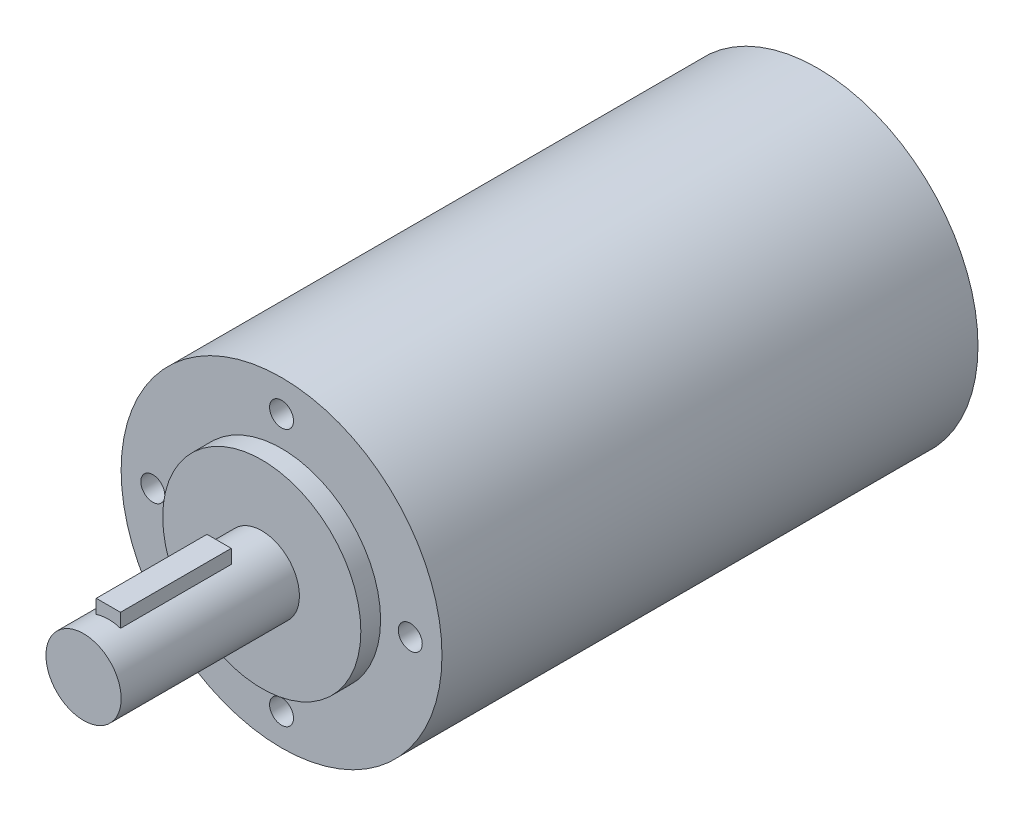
ISO-10303-21;
HEADER;
FILE_DESCRIPTION(('STEP AP214'),'2;1');
FILE_NAME('part.step','',(''),(''),'','','');
FILE_SCHEMA(('AUTOMOTIVE_DESIGN { 1 0 10303 214 1 1 1 1 }'));
ENDSEC;
DATA;
#1=APPLICATION_CONTEXT('core data for automotive mechanical design processes');
#2=APPLICATION_PROTOCOL_DEFINITION('international standard','automotive_design',2000,#1);
#3=PRODUCT_CONTEXT('',#1,'mechanical');
#4=PRODUCT('Part','Part','',(#3));
#5=PRODUCT_RELATED_PRODUCT_CATEGORY('part','',(#4));
#6=PRODUCT_DEFINITION_FORMATION('','',#4);
#7=PRODUCT_DEFINITION_CONTEXT('part definition',#1,'design');
#8=PRODUCT_DEFINITION('design','',#6,#7);
#9=PRODUCT_DEFINITION_SHAPE('','',#8);
#10=(LENGTH_UNIT() NAMED_UNIT(*) SI_UNIT(.MILLI.,.METRE.));
#11=(NAMED_UNIT(*) PLANE_ANGLE_UNIT() SI_UNIT($,.RADIAN.));
#12=(NAMED_UNIT(*) SI_UNIT($,.STERADIAN.) SOLID_ANGLE_UNIT());
#13=UNCERTAINTY_MEASURE_WITH_UNIT(LENGTH_MEASURE(1.E-05),#10,'distance_accuracy_value','');
#14=(GEOMETRIC_REPRESENTATION_CONTEXT(3) GLOBAL_UNCERTAINTY_ASSIGNED_CONTEXT((#13)) GLOBAL_UNIT_ASSIGNED_CONTEXT((#10,
#11,#12)) REPRESENTATION_CONTEXT('',''));
#15=CARTESIAN_POINT('',(0.,0.,0.));
#16=DIRECTION('',(0.,0.,1.));
#17=DIRECTION('',(1.,0.,0.));
#18=AXIS2_PLACEMENT_3D('',#15,#16,#17);
#19=CARTESIAN_POINT('',(0.,0.,186.817));
#20=DIRECTION('',(0.,0.,-1.));
#21=DIRECTION('',(-1.,0.,0.));
#22=AXIS2_PLACEMENT_3D('',#19,#20,#21);
#23=CYLINDRICAL_SURFACE('',#22,9.5758);
#24=CARTESIAN_POINT('',(0.,0.,141.4526));
#25=DIRECTION('',(0.,0.,1.));
#26=DIRECTION('',(1.,0.,0.));
#27=AXIS2_PLACEMENT_3D('',#24,#25,#26);
#28=CIRCLE('',#27,9.5758);
#29=CARTESIAN_POINT('',(9.5758,0.,141.4526));
#30=VERTEX_POINT('',#29);
#31=EDGE_CURVE('E123',#30,#30,#28,.T.);
#32=ORIENTED_EDGE('',*,*,#31,.T.);
#33=EDGE_LOOP('',(#32));
#34=FACE_BOUND('',#33,.T.);
#35=CARTESIAN_POINT('',(0.,0.,186.817));
#36=DIRECTION('',(0.,0.,1.));
#37=DIRECTION('',(1.,0.,0.));
#38=AXIS2_PLACEMENT_3D('',#35,#36,#37);
#39=CIRCLE('',#38,9.5758);
#40=CARTESIAN_POINT('',(9.5758,0.,186.817));
#41=VERTEX_POINT('',#40);
#42=EDGE_CURVE('E126',#41,#41,#39,.T.);
#43=ORIENTED_EDGE('',*,*,#42,.F.);
#44=EDGE_LOOP('',(#43));
#45=FACE_BOUND('',#44,.T.);
#46=DIRECTION('',(0.,0.,-1.));
#47=VECTOR('',#46,1.);
#48=CARTESIAN_POINT('',(-3.12419999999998,9.05181307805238,186.817));
#49=LINE('',#48,#47);
#50=CARTESIAN_POINT('',(-3.12419999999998,9.05181307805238,152.273));
#51=VERTEX_POINT('',#50);
#52=CARTESIAN_POINT('',(-3.12419999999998,9.05181307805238,180.467));
#53=VERTEX_POINT('',#52);
#54=EDGE_CURVE('E11',#51,#53,#49,.F.);
#55=ORIENTED_EDGE('',*,*,#54,.F.);
#56=CARTESIAN_POINT('',(0.,0.,152.273));
#57=DIRECTION('',(0.,0.,1.));
#58=DIRECTION('',(1.,0.,0.));
#59=AXIS2_PLACEMENT_3D('',#56,#57,#58);
#60=CIRCLE('',#59,9.5758);
#61=CARTESIAN_POINT('',(3.04800000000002,9.07775531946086,152.273));
#62=VERTEX_POINT('',#61);
#63=EDGE_CURVE('E147',#62,#51,#60,.T.);
#64=ORIENTED_EDGE('',*,*,#63,.F.);
#65=DIRECTION('',(0.,0.,-1.));
#66=VECTOR('',#65,1.);
#67=CARTESIAN_POINT('',(3.04800000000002,9.07775531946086,186.817));
#68=LINE('',#67,#66);
#69=CARTESIAN_POINT('',(3.04800000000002,9.07775531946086,180.467));
#70=VERTEX_POINT('',#69);
#71=EDGE_CURVE('E54',#70,#62,#68,.T.);
#72=ORIENTED_EDGE('',*,*,#71,.F.);
#73=CARTESIAN_POINT('',(0.,0.,180.467));
#74=DIRECTION('',(0.,0.,-1.));
#75=DIRECTION('',(-1.,0.,0.));
#76=AXIS2_PLACEMENT_3D('',#73,#74,#75);
#77=CIRCLE('',#76,9.5758);
#78=EDGE_CURVE('E44',#53,#70,#77,.T.);
#79=ORIENTED_EDGE('',*,*,#78,.F.);
#80=EDGE_LOOP('',(#55,#64,#72,#79));
#81=FACE_BOUND('',#80,.T.);
#82=ADVANCED_FACE('F36',(#34,#45,#81),#23,.T.);
#83=CARTESIAN_POINT('',(0.,0.,141.4526));
#84=DIRECTION('',(0.,0.,1.));
#85=DIRECTION('',(1.,0.,0.));
#86=AXIS2_PLACEMENT_3D('',#83,#84,#85);
#87=PLANE('',#86);
#88=CARTESIAN_POINT('',(0.,0.,141.4526));
#89=DIRECTION('',(0.,0.,1.));
#90=DIRECTION('',(1.,0.,0.));
#91=AXIS2_PLACEMENT_3D('',#88,#89,#90);
#92=CIRCLE('',#91,25.2095);
#93=CARTESIAN_POINT('',(25.2095,0.,141.4526));
#94=VERTEX_POINT('',#93);
#95=EDGE_CURVE('E132',#94,#94,#92,.T.);
#96=ORIENTED_EDGE('',*,*,#95,.T.);
#97=EDGE_LOOP('',(#96));
#98=FACE_BOUND('',#97,.T.);
#99=ORIENTED_EDGE('',*,*,#31,.F.);
#100=EDGE_LOOP('',(#99));
#101=FACE_BOUND('',#100,.T.);
#102=ADVANCED_FACE('F161',(#98,#101),#87,.T.);
#103=CARTESIAN_POINT('',(0.,0.,136.4234));
#104=DIRECTION('',(0.,0.,1.));
#105=DIRECTION('',(1.,0.,0.));
#106=AXIS2_PLACEMENT_3D('',#103,#104,#105);
#107=PLANE('',#106);
#108=CARTESIAN_POINT('',(-32.766,3.43204197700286E-13,136.4234));
#109=DIRECTION('',(0.,0.,1.));
#110=DIRECTION('',(0.,1.,0.));
#111=AXIS2_PLACEMENT_3D('',#108,#109,#110);
#112=CIRCLE('',#111,3.048);
#113=CARTESIAN_POINT('',(-32.766,3.04800000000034,136.4234));
#114=VERTEX_POINT('',#113);
#115=EDGE_CURVE('E94',#114,#114,#112,.T.);
#116=ORIENTED_EDGE('',*,*,#115,.F.);
#117=EDGE_LOOP('',(#116));
#118=FACE_BOUND('',#117,.T.);
#119=CARTESIAN_POINT('',(-2.28800539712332E-13,-32.766,136.4234));
#120=DIRECTION('',(0.,0.,1.));
#121=DIRECTION('',(-1.,0.,0.));
#122=AXIS2_PLACEMENT_3D('',#119,#120,#121);
#123=CIRCLE('',#122,3.048);
#124=CARTESIAN_POINT('',(-3.04800000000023,-32.766,136.4234));
#125=VERTEX_POINT('',#124);
#126=EDGE_CURVE('E105',#125,#125,#123,.T.);
#127=ORIENTED_EDGE('',*,*,#126,.F.);
#128=EDGE_LOOP('',(#127));
#129=FACE_BOUND('',#128,.T.);
#130=CARTESIAN_POINT('',(32.766,-1.14396881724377E-13,136.4234));
#131=DIRECTION('',(0.,0.,1.));
#132=DIRECTION('',(0.,-1.,0.));
#133=AXIS2_PLACEMENT_3D('',#130,#131,#132);
#134=CIRCLE('',#133,3.048);
#135=CARTESIAN_POINT('',(32.766,-3.04800000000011,136.4234));
#136=VERTEX_POINT('',#135);
#137=EDGE_CURVE('E111',#136,#136,#134,.T.);
#138=ORIENTED_EDGE('',*,*,#137,.F.);
#139=EDGE_LOOP('',(#138));
#140=FACE_BOUND('',#139,.T.);
#141=CARTESIAN_POINT('',(0.,32.766,136.4234));
#142=DIRECTION('',(0.,0.,1.));
#143=DIRECTION('',(1.,0.,0.));
#144=AXIS2_PLACEMENT_3D('',#141,#142,#143);
#145=CIRCLE('',#144,3.048);
#146=CARTESIAN_POINT('',(3.048,32.766,136.4234));
#147=VERTEX_POINT('',#146);
#148=EDGE_CURVE('E117',#147,#147,#145,.T.);
#149=ORIENTED_EDGE('',*,*,#148,.F.);
#150=EDGE_LOOP('',(#149));
#151=FACE_BOUND('',#150,.T.);
#152=CARTESIAN_POINT('',(0.,0.,136.4234));
#153=DIRECTION('',(0.,0.,1.));
#154=DIRECTION('',(1.,0.,0.));
#155=AXIS2_PLACEMENT_3D('',#152,#153,#154);
#156=CIRCLE('',#155,40.8305);
#157=CARTESIAN_POINT('',(40.8305,0.,136.4234));
#158=VERTEX_POINT('',#157);
#159=EDGE_CURVE('E144',#158,#158,#156,.T.);
#160=ORIENTED_EDGE('',*,*,#159,.T.);
#161=EDGE_LOOP('',(#160));
#162=FACE_BOUND('',#161,.T.);
#163=CARTESIAN_POINT('',(0.,0.,136.4234));
#164=DIRECTION('',(0.,0.,1.));
#165=DIRECTION('',(1.,0.,0.));
#166=AXIS2_PLACEMENT_3D('',#163,#164,#165);
#167=CIRCLE('',#166,25.2095);
#168=CARTESIAN_POINT('',(25.2095,0.,136.4234));
#169=VERTEX_POINT('',#168);
#170=EDGE_CURVE('E129',#169,#169,#167,.T.);
#171=ORIENTED_EDGE('',*,*,#170,.F.);
#172=EDGE_LOOP('',(#171));
#173=FACE_BOUND('',#172,.T.);
#174=ADVANCED_FACE('F167',(#118,#129,#140,#151,#162,#173),#107,.T.);
#175=CARTESIAN_POINT('',(0.,0.,136.4234));
#176=DIRECTION('',(0.,0.,-1.));
#177=DIRECTION('',(-1.,0.,0.));
#178=AXIS2_PLACEMENT_3D('',#175,#176,#177);
#179=CYLINDRICAL_SURFACE('',#178,40.8305);
#180=ORIENTED_EDGE('',*,*,#159,.F.);
#181=EDGE_LOOP('',(#180));
#182=FACE_BOUND('',#181,.T.);
#183=CARTESIAN_POINT('',(0.,0.,0.));
#184=DIRECTION('',(0.,0.,1.));
#185=DIRECTION('',(1.,0.,0.));
#186=AXIS2_PLACEMENT_3D('',#183,#184,#185);
#187=CIRCLE('',#186,40.8305);
#188=CARTESIAN_POINT('',(40.8305,0.,0.));
#189=VERTEX_POINT('',#188);
#190=EDGE_CURVE('E141',#189,#189,#187,.T.);
#191=ORIENTED_EDGE('',*,*,#190,.T.);
#192=EDGE_LOOP('',(#191));
#193=FACE_BOUND('',#192,.T.);
#194=ADVANCED_FACE('F38',(#182,#193),#179,.T.);
#195=CARTESIAN_POINT('',(0.,0.,0.));
#196=DIRECTION('',(0.,0.,1.));
#197=DIRECTION('',(1.,0.,0.));
#198=AXIS2_PLACEMENT_3D('',#195,#196,#197);
#199=PLANE('',#198);
#200=CARTESIAN_POINT('',(0.,0.,0.));
#201=DIRECTION('',(0.,0.,-1.));
#202=DIRECTION('',(-1.,0.,0.));
#203=AXIS2_PLACEMENT_3D('',#200,#201,#202);
#204=CIRCLE('',#203,18.161);
#205=CARTESIAN_POINT('',(-18.161,0.,0.));
#206=VERTEX_POINT('',#205);
#207=EDGE_CURVE('E135',#206,#206,#204,.T.);
#208=ORIENTED_EDGE('',*,*,#207,.F.);
#209=EDGE_LOOP('',(#208));
#210=FACE_BOUND('',#209,.T.);
#211=ORIENTED_EDGE('',*,*,#190,.F.);
#212=EDGE_LOOP('',(#211));
#213=FACE_BOUND('',#212,.T.);
#214=ADVANCED_FACE('F186',(#210,#213),#199,.F.);
#215=CARTESIAN_POINT('',(0.,0.,4.7498));
#216=DIRECTION('',(0.,0.,-1.));
#217=DIRECTION('',(-1.,0.,0.));
#218=AXIS2_PLACEMENT_3D('',#215,#216,#217);
#219=CYLINDRICAL_SURFACE('',#218,18.161);
#220=CARTESIAN_POINT('',(0.,0.,4.7498));
#221=DIRECTION('',(0.,0.,-1.));
#222=DIRECTION('',(-1.,0.,0.));
#223=AXIS2_PLACEMENT_3D('',#220,#221,#222);
#224=CIRCLE('',#223,18.161);
#225=CARTESIAN_POINT('',(-18.161,0.,4.7498));
#226=VERTEX_POINT('',#225);
#227=EDGE_CURVE('E138',#226,#226,#224,.T.);
#228=ORIENTED_EDGE('',*,*,#227,.F.);
#229=EDGE_LOOP('',(#228));
#230=FACE_BOUND('',#229,.T.);
#231=ORIENTED_EDGE('',*,*,#207,.T.);
#232=EDGE_LOOP('',(#231));
#233=FACE_BOUND('',#232,.T.);
#234=ADVANCED_FACE('F182',(#230,#233),#219,.F.);
#235=CARTESIAN_POINT('',(0.,0.,4.7498));
#236=DIRECTION('',(0.,0.,-1.));
#237=DIRECTION('',(-1.,0.,0.));
#238=AXIS2_PLACEMENT_3D('',#235,#236,#237);
#239=PLANE('',#238);
#240=ORIENTED_EDGE('',*,*,#227,.T.);
#241=EDGE_LOOP('',(#240));
#242=FACE_BOUND('',#241,.T.);
#243=ADVANCED_FACE('F178',(#242),#239,.T.);
#244=CARTESIAN_POINT('',(0.,0.,141.4526));
#245=DIRECTION('',(0.,0.,-1.));
#246=DIRECTION('',(-1.,0.,0.));
#247=AXIS2_PLACEMENT_3D('',#244,#245,#246);
#248=CYLINDRICAL_SURFACE('',#247,25.2095);
#249=ORIENTED_EDGE('',*,*,#95,.F.);
#250=EDGE_LOOP('',(#249));
#251=FACE_BOUND('',#250,.T.);
#252=ORIENTED_EDGE('',*,*,#170,.T.);
#253=EDGE_LOOP('',(#252));
#254=FACE_BOUND('',#253,.T.);
#255=ADVANCED_FACE('F175',(#251,#254),#248,.T.);
#256=CARTESIAN_POINT('',(0.,0.,186.817));
#257=DIRECTION('',(0.,0.,1.));
#258=DIRECTION('',(1.,0.,0.));
#259=AXIS2_PLACEMENT_3D('',#256,#257,#258);
#260=PLANE('',#259);
#261=ORIENTED_EDGE('',*,*,#42,.T.);
#262=EDGE_LOOP('',(#261));
#263=FACE_BOUND('',#262,.T.);
#264=ADVANCED_FACE('F172',(#263),#260,.T.);
#265=CARTESIAN_POINT('',(0.,32.766,121.1834));
#266=DIRECTION('',(0.,0.,1.));
#267=DIRECTION('',(1.,0.,0.));
#268=AXIS2_PLACEMENT_3D('',#265,#266,#267);
#269=CYLINDRICAL_SURFACE('',#268,3.048);
#270=CARTESIAN_POINT('',(0.,32.766,121.1834));
#271=DIRECTION('',(0.,0.,1.));
#272=DIRECTION('',(1.,0.,0.));
#273=AXIS2_PLACEMENT_3D('',#270,#271,#272);
#274=CIRCLE('',#273,3.048);
#275=CARTESIAN_POINT('',(3.048,32.766,121.1834));
#276=VERTEX_POINT('',#275);
#277=EDGE_CURVE('E120',#276,#276,#274,.T.);
#278=ORIENTED_EDGE('',*,*,#277,.F.);
#279=EDGE_LOOP('',(#278));
#280=FACE_BOUND('',#279,.T.);
#281=ORIENTED_EDGE('',*,*,#148,.T.);
#282=EDGE_LOOP('',(#281));
#283=FACE_BOUND('',#282,.T.);
#284=ADVANCED_FACE('F212',(#280,#283),#269,.F.);
#285=CARTESIAN_POINT('',(0.,32.766,121.1834));
#286=DIRECTION('',(0.,0.,1.));
#287=DIRECTION('',(1.,0.,0.));
#288=AXIS2_PLACEMENT_3D('',#285,#286,#287);
#289=PLANE('',#288);
#290=ORIENTED_EDGE('',*,*,#277,.T.);
#291=EDGE_LOOP('',(#290));
#292=FACE_BOUND('',#291,.T.);
#293=ADVANCED_FACE('F214',(#292),#289,.T.);
#294=CARTESIAN_POINT('',(32.766,-1.14396881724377E-13,121.1834));
#295=DIRECTION('',(0.,0.,1.));
#296=DIRECTION('',(1.,0.,0.));
#297=AXIS2_PLACEMENT_3D('',#294,#295,#296);
#298=CYLINDRICAL_SURFACE('',#297,3.048);
#299=CARTESIAN_POINT('',(32.766,-1.14396881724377E-13,121.1834));
#300=DIRECTION('',(0.,0.,1.));
#301=DIRECTION('',(0.,-1.,0.));
#302=AXIS2_PLACEMENT_3D('',#299,#300,#301);
#303=CIRCLE('',#302,3.048);
#304=CARTESIAN_POINT('',(32.766,-3.04800000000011,121.1834));
#305=VERTEX_POINT('',#304);
#306=EDGE_CURVE('E114',#305,#305,#303,.T.);
#307=ORIENTED_EDGE('',*,*,#306,.F.);
#308=EDGE_LOOP('',(#307));
#309=FACE_BOUND('',#308,.T.);
#310=ORIENTED_EDGE('',*,*,#137,.T.);
#311=EDGE_LOOP('',(#310));
#312=FACE_BOUND('',#311,.T.);
#313=ADVANCED_FACE('F220',(#309,#312),#298,.F.);
#314=CARTESIAN_POINT('',(32.766,-1.14396881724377E-13,121.1834));
#315=DIRECTION('',(0.,0.,1.));
#316=DIRECTION('',(0.,-1.,0.));
#317=AXIS2_PLACEMENT_3D('',#314,#315,#316);
#318=PLANE('',#317);
#319=ORIENTED_EDGE('',*,*,#306,.T.);
#320=EDGE_LOOP('',(#319));
#321=FACE_BOUND('',#320,.T.);
#322=ADVANCED_FACE('F228',(#321),#318,.T.);
#323=CARTESIAN_POINT('',(-2.28800539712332E-13,-32.766,121.1834));
#324=DIRECTION('',(0.,0.,1.));
#325=DIRECTION('',(1.,0.,0.));
#326=AXIS2_PLACEMENT_3D('',#323,#324,#325);
#327=CYLINDRICAL_SURFACE('',#326,3.048);
#328=CARTESIAN_POINT('',(-2.28800539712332E-13,-32.766,121.1834));
#329=DIRECTION('',(0.,0.,1.));
#330=DIRECTION('',(-1.,0.,0.));
#331=AXIS2_PLACEMENT_3D('',#328,#329,#330);
#332=CIRCLE('',#331,3.048);
#333=CARTESIAN_POINT('',(-3.04800000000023,-32.766,121.1834));
#334=VERTEX_POINT('',#333);
#335=EDGE_CURVE('E108',#334,#334,#332,.T.);
#336=ORIENTED_EDGE('',*,*,#335,.F.);
#337=EDGE_LOOP('',(#336));
#338=FACE_BOUND('',#337,.T.);
#339=ORIENTED_EDGE('',*,*,#126,.T.);
#340=EDGE_LOOP('',(#339));
#341=FACE_BOUND('',#340,.T.);
#342=ADVANCED_FACE('F232',(#338,#341),#327,.F.);
#343=CARTESIAN_POINT('',(-2.28800539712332E-13,-32.766,121.1834));
#344=DIRECTION('',(0.,0.,1.));
#345=DIRECTION('',(-1.,0.,0.));
#346=AXIS2_PLACEMENT_3D('',#343,#344,#345);
#347=PLANE('',#346);
#348=ORIENTED_EDGE('',*,*,#335,.T.);
#349=EDGE_LOOP('',(#348));
#350=FACE_BOUND('',#349,.T.);
#351=ADVANCED_FACE('F236',(#350),#347,.T.);
#352=CARTESIAN_POINT('',(-32.766,3.43204197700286E-13,121.1834));
#353=DIRECTION('',(0.,0.,1.));
#354=DIRECTION('',(1.,0.,0.));
#355=AXIS2_PLACEMENT_3D('',#352,#353,#354);
#356=CYLINDRICAL_SURFACE('',#355,3.048);
#357=CARTESIAN_POINT('',(-32.766,3.43204197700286E-13,121.1834));
#358=DIRECTION('',(0.,0.,1.));
#359=DIRECTION('',(0.,1.,0.));
#360=AXIS2_PLACEMENT_3D('',#357,#358,#359);
#361=CIRCLE('',#360,3.048);
#362=CARTESIAN_POINT('',(-32.766,3.04800000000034,121.1834));
#363=VERTEX_POINT('',#362);
#364=EDGE_CURVE('E97',#363,#363,#361,.T.);
#365=ORIENTED_EDGE('',*,*,#364,.F.);
#366=EDGE_LOOP('',(#365));
#367=FACE_BOUND('',#366,.T.);
#368=ORIENTED_EDGE('',*,*,#115,.T.);
#369=EDGE_LOOP('',(#368));
#370=FACE_BOUND('',#369,.T.);
#371=ADVANCED_FACE('F240',(#367,#370),#356,.F.);
#372=CARTESIAN_POINT('',(-32.766,3.43204197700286E-13,121.1834));
#373=DIRECTION('',(0.,0.,1.));
#374=DIRECTION('',(0.,1.,0.));
#375=AXIS2_PLACEMENT_3D('',#372,#373,#374);
#376=PLANE('',#375);
#377=ORIENTED_EDGE('',*,*,#364,.T.);
#378=EDGE_LOOP('',(#377));
#379=FACE_BOUND('',#378,.T.);
#380=ADVANCED_FACE('F244',(#379),#376,.T.);
#381=CARTESIAN_POINT('',(-3.12419999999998,12.6238,180.467));
#382=DIRECTION('',(1.,0.,0.));
#383=DIRECTION('',(0.,0.,-1.));
#384=AXIS2_PLACEMENT_3D('',#381,#382,#383);
#385=PLANE('',#384);
#386=DIRECTION('',(0.,-1.,0.));
#387=VECTOR('',#386,1.);
#388=CARTESIAN_POINT('',(-3.12419999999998,12.6238,152.273));
#389=LINE('',#388,#387);
#390=CARTESIAN_POINT('',(-3.12419999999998,12.6238,152.273));
#391=VERTEX_POINT('',#390);
#392=EDGE_CURVE('E155',#391,#51,#389,.T.);
#393=ORIENTED_EDGE('',*,*,#392,.T.);
#394=ORIENTED_EDGE('',*,*,#54,.T.);
#395=DIRECTION('',(0.,-1.,0.));
#396=VECTOR('',#395,1.);
#397=CARTESIAN_POINT('',(-3.12419999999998,12.6238,180.467));
#398=LINE('',#397,#396);
#399=CARTESIAN_POINT('',(-3.12419999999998,12.6238,180.467));
#400=VERTEX_POINT('',#399);
#401=EDGE_CURVE('E77',#400,#53,#398,.T.);
#402=ORIENTED_EDGE('',*,*,#401,.F.);
#403=DIRECTION('',(0.,0.,1.));
#404=VECTOR('',#403,1.);
#405=CARTESIAN_POINT('',(-3.12419999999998,12.6238,180.467));
#406=LINE('',#405,#404);
#407=EDGE_CURVE('E83',#391,#400,#406,.T.);
#408=ORIENTED_EDGE('',*,*,#407,.F.);
#409=EDGE_LOOP('',(#393,#394,#402,#408));
#410=FACE_BOUND('',#409,.T.);
#411=ADVANCED_FACE('F93',(#410),#385,.F.);
#412=CARTESIAN_POINT('',(-3.12419999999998,12.6238,180.467));
#413=DIRECTION('',(0.,0.,-1.));
#414=DIRECTION('',(-1.,0.,0.));
#415=AXIS2_PLACEMENT_3D('',#412,#413,#414);
#416=PLANE('',#415);
#417=ORIENTED_EDGE('',*,*,#401,.T.);
#418=ORIENTED_EDGE('',*,*,#78,.T.);
#419=DIRECTION('',(0.,-1.,0.));
#420=VECTOR('',#419,1.);
#421=CARTESIAN_POINT('',(3.04800000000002,12.6238,180.467));
#422=LINE('',#421,#420);
#423=CARTESIAN_POINT('',(3.04800000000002,12.6238,180.467));
#424=VERTEX_POINT('',#423);
#425=EDGE_CURVE('E79',#424,#70,#422,.T.);
#426=ORIENTED_EDGE('',*,*,#425,.F.);
#427=DIRECTION('',(1.,0.,0.));
#428=VECTOR('',#427,1.);
#429=CARTESIAN_POINT('',(-3.12419999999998,12.6238,180.467));
#430=LINE('',#429,#428);
#431=EDGE_CURVE('E73',#400,#424,#430,.T.);
#432=ORIENTED_EDGE('',*,*,#431,.F.);
#433=EDGE_LOOP('',(#417,#418,#426,#432));
#434=FACE_BOUND('',#433,.T.);
#435=ADVANCED_FACE('F75',(#434),#416,.F.);
#436=CARTESIAN_POINT('',(3.04800000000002,12.6238,180.467));
#437=DIRECTION('',(-1.,0.,0.));
#438=DIRECTION('',(0.,0.,1.));
#439=AXIS2_PLACEMENT_3D('',#436,#437,#438);
#440=PLANE('',#439);
#441=ORIENTED_EDGE('',*,*,#425,.T.);
#442=ORIENTED_EDGE('',*,*,#71,.T.);
#443=DIRECTION('',(0.,-1.,0.));
#444=VECTOR('',#443,1.);
#445=CARTESIAN_POINT('',(3.04800000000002,12.6238,152.273));
#446=LINE('',#445,#444);
#447=CARTESIAN_POINT('',(3.04800000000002,12.6238,152.273));
#448=VERTEX_POINT('',#447);
#449=EDGE_CURVE('E99',#448,#62,#446,.T.);
#450=ORIENTED_EDGE('',*,*,#449,.F.);
#451=DIRECTION('',(0.,0.,-1.));
#452=VECTOR('',#451,1.);
#453=CARTESIAN_POINT('',(3.04800000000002,12.6238,180.467));
#454=LINE('',#453,#452);
#455=EDGE_CURVE('E82',#424,#448,#454,.T.);
#456=ORIENTED_EDGE('',*,*,#455,.F.);
#457=EDGE_LOOP('',(#441,#442,#450,#456));
#458=FACE_BOUND('',#457,.T.);
#459=ADVANCED_FACE('F151',(#458),#440,.F.);
#460=CARTESIAN_POINT('',(-3.12419999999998,12.6238,152.273));
#461=DIRECTION('',(0.,0.,1.));
#462=DIRECTION('',(1.,0.,0.));
#463=AXIS2_PLACEMENT_3D('',#460,#461,#462);
#464=PLANE('',#463);
#465=ORIENTED_EDGE('',*,*,#449,.T.);
#466=ORIENTED_EDGE('',*,*,#63,.T.);
#467=ORIENTED_EDGE('',*,*,#392,.F.);
#468=DIRECTION('',(-1.,0.,0.));
#469=VECTOR('',#468,1.);
#470=CARTESIAN_POINT('',(-3.12419999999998,12.6238,152.273));
#471=LINE('',#470,#469);
#472=EDGE_CURVE('E88',#448,#391,#471,.T.);
#473=ORIENTED_EDGE('',*,*,#472,.F.);
#474=EDGE_LOOP('',(#465,#466,#467,#473));
#475=FACE_BOUND('',#474,.T.);
#476=ADVANCED_FACE('F159',(#475),#464,.F.);
#477=CARTESIAN_POINT('',(-3.12419999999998,12.6238,152.273));
#478=DIRECTION('',(0.,-1.,0.));
#479=DIRECTION('',(0.,0.,-1.));
#480=AXIS2_PLACEMENT_3D('',#477,#478,#479);
#481=PLANE('',#480);
#482=ORIENTED_EDGE('',*,*,#407,.T.);
#483=ORIENTED_EDGE('',*,*,#431,.T.);
#484=ORIENTED_EDGE('',*,*,#455,.T.);
#485=ORIENTED_EDGE('',*,*,#472,.T.);
#486=EDGE_LOOP('',(#482,#483,#484,#485));
#487=FACE_BOUND('',#486,.T.);
#488=ADVANCED_FACE('F86',(#487),#481,.F.);
#489=CLOSED_SHELL('',(#82,#102,#174,#194,#214,#234,#243,#255,#264,#284,#293,#313,#322,#342,#351,
#371,#380,#411,#435,#459,#476,#488));
#490=MANIFOLD_SOLID_BREP('B2',#489);
#491=ADVANCED_BREP_SHAPE_REPRESENTATION('',(#18,#490),#14);
#492=SHAPE_DEFINITION_REPRESENTATION(#9,#491);
ENDSEC;
END-ISO-10303-21;
